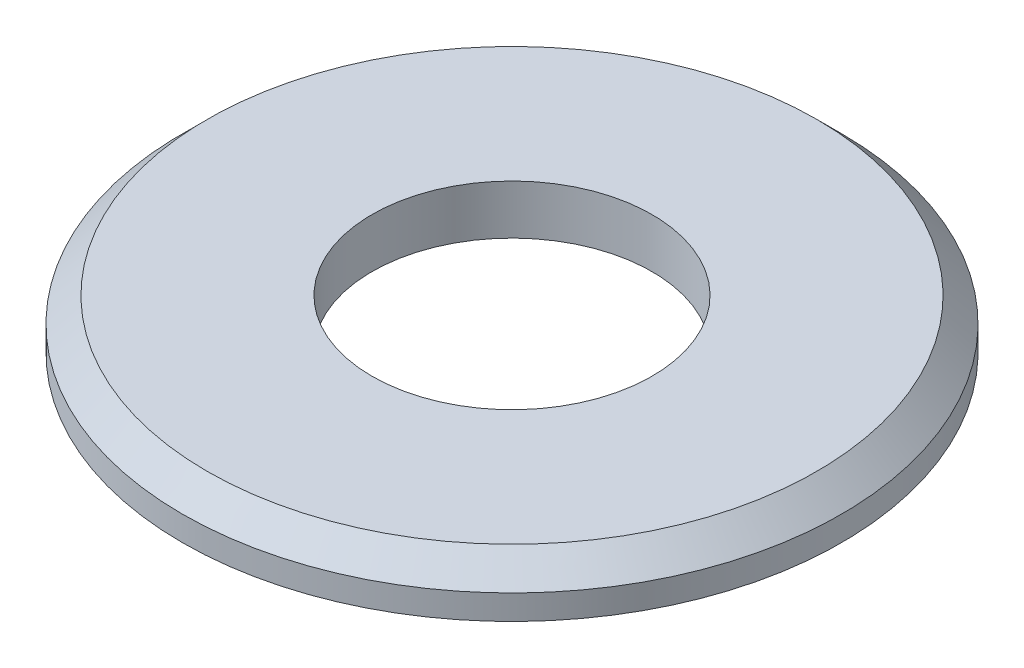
ISO-10303-21;
HEADER;
FILE_DESCRIPTION(('STEP AP214'),'2;1');
FILE_NAME('part.step','',(''),(''),'','','');
FILE_SCHEMA(('AUTOMOTIVE_DESIGN { 1 0 10303 214 1 1 1 1 }'));
ENDSEC;
DATA;
#1=APPLICATION_CONTEXT('core data for automotive mechanical design processes');
#2=APPLICATION_PROTOCOL_DEFINITION('international standard','automotive_design',2000,#1);
#3=PRODUCT_CONTEXT('',#1,'mechanical');
#4=PRODUCT('Part','Part','',(#3));
#5=PRODUCT_RELATED_PRODUCT_CATEGORY('part','',(#4));
#6=PRODUCT_DEFINITION_FORMATION('','',#4);
#7=PRODUCT_DEFINITION_CONTEXT('part definition',#1,'design');
#8=PRODUCT_DEFINITION('design','',#6,#7);
#9=PRODUCT_DEFINITION_SHAPE('','',#8);
#10=(LENGTH_UNIT() NAMED_UNIT(*) SI_UNIT(.MILLI.,.METRE.));
#11=(NAMED_UNIT(*) PLANE_ANGLE_UNIT() SI_UNIT($,.RADIAN.));
#12=(NAMED_UNIT(*) SI_UNIT($,.STERADIAN.) SOLID_ANGLE_UNIT());
#13=UNCERTAINTY_MEASURE_WITH_UNIT(LENGTH_MEASURE(1.E-05),#10,'distance_accuracy_value','');
#14=(GEOMETRIC_REPRESENTATION_CONTEXT(3) GLOBAL_UNCERTAINTY_ASSIGNED_CONTEXT((#13)) GLOBAL_UNIT_ASSIGNED_CONTEXT((#10,
#11,#12)) REPRESENTATION_CONTEXT('',''));
#15=CARTESIAN_POINT('',(0.,0.,0.));
#16=DIRECTION('',(0.,0.,1.));
#17=DIRECTION('',(1.,0.,0.));
#18=AXIS2_PLACEMENT_3D('',#15,#16,#17);
#19=CARTESIAN_POINT('',(0.,0.3,0.));
#20=DIRECTION('',(0.,1.,0.));
#21=DIRECTION('',(0.,0.,1.));
#22=AXIS2_PLACEMENT_3D('',#19,#20,#21);
#23=PLANE('',#22);
#24=CARTESIAN_POINT('',(0.,0.3,0.));
#25=DIRECTION('',(0.,1.,0.));
#26=DIRECTION('',(0.,0.,1.));
#27=AXIS2_PLACEMENT_3D('',#24,#25,#26);
#28=CIRCLE('',#27,1.85);
#29=CARTESIAN_POINT('',(0.,0.3,1.85));
#30=VERTEX_POINT('',#29);
#31=EDGE_CURVE('E35',#30,#30,#28,.T.);
#32=ORIENTED_EDGE('',*,*,#31,.T.);
#33=EDGE_LOOP('',(#32));
#34=FACE_BOUND('',#33,.T.);
#35=CARTESIAN_POINT('',(0.,0.3,0.));
#36=DIRECTION('',(0.,1.,0.));
#37=DIRECTION('',(0.,0.,1.));
#38=AXIS2_PLACEMENT_3D('',#35,#36,#37);
#39=CIRCLE('',#38,0.85);
#40=CARTESIAN_POINT('',(0.,0.3,0.85));
#41=VERTEX_POINT('',#40);
#42=EDGE_CURVE('E43',#41,#41,#39,.T.);
#43=ORIENTED_EDGE('',*,*,#42,.F.);
#44=EDGE_LOOP('',(#43));
#45=FACE_BOUND('',#44,.T.);
#46=ADVANCED_FACE('F28',(#34,#45),#23,.T.);
#47=CARTESIAN_POINT('',(0.,0.,0.));
#48=DIRECTION('',(0.,1.,0.));
#49=DIRECTION('',(0.,0.,1.));
#50=AXIS2_PLACEMENT_3D('',#47,#48,#49);
#51=PLANE('',#50);
#52=CARTESIAN_POINT('',(0.,0.,0.));
#53=DIRECTION('',(0.,1.,0.));
#54=DIRECTION('',(0.,0.,1.));
#55=AXIS2_PLACEMENT_3D('',#52,#53,#54);
#56=CIRCLE('',#55,2.);
#57=CARTESIAN_POINT('',(0.,0.,2.));
#58=VERTEX_POINT('',#57);
#59=EDGE_CURVE('E39',#58,#58,#56,.T.);
#60=ORIENTED_EDGE('',*,*,#59,.F.);
#61=EDGE_LOOP('',(#60));
#62=FACE_BOUND('',#61,.T.);
#63=CARTESIAN_POINT('',(0.,0.,0.));
#64=DIRECTION('',(0.,1.,0.));
#65=DIRECTION('',(0.,0.,1.));
#66=AXIS2_PLACEMENT_3D('',#63,#64,#65);
#67=CIRCLE('',#66,0.85);
#68=CARTESIAN_POINT('',(0.,0.,0.85));
#69=VERTEX_POINT('',#68);
#70=EDGE_CURVE('E48',#69,#69,#67,.T.);
#71=ORIENTED_EDGE('',*,*,#70,.T.);
#72=EDGE_LOOP('',(#71));
#73=FACE_BOUND('',#72,.T.);
#74=ADVANCED_FACE('F52',(#62,#73),#51,.F.);
#75=CARTESIAN_POINT('',(0.,0.3,0.));
#76=DIRECTION('',(0.,-1.,0.));
#77=DIRECTION('',(0.,0.,-1.));
#78=AXIS2_PLACEMENT_3D('',#75,#76,#77);
#79=CYLINDRICAL_SURFACE('',#78,2.);
#80=CARTESIAN_POINT('',(0.,0.15,0.));
#81=DIRECTION('',(0.,1.,0.));
#82=DIRECTION('',(0.,0.,1.));
#83=AXIS2_PLACEMENT_3D('',#80,#81,#82);
#84=CIRCLE('',#83,2.);
#85=CARTESIAN_POINT('',(0.,0.15,2.));
#86=VERTEX_POINT('',#85);
#87=EDGE_CURVE('E10',#86,#86,#84,.F.);
#88=ORIENTED_EDGE('',*,*,#87,.T.);
#89=EDGE_LOOP('',(#88));
#90=FACE_BOUND('',#89,.T.);
#91=ORIENTED_EDGE('',*,*,#59,.T.);
#92=EDGE_LOOP('',(#91));
#93=FACE_BOUND('',#92,.T.);
#94=ADVANCED_FACE('F30',(#90,#93),#79,.T.);
#95=CARTESIAN_POINT('',(0.,0.3,0.));
#96=DIRECTION('',(0.,-1.,0.));
#97=DIRECTION('',(0.,0.,-1.));
#98=AXIS2_PLACEMENT_3D('',#95,#96,#97);
#99=CYLINDRICAL_SURFACE('',#98,0.85);
#100=ORIENTED_EDGE('',*,*,#42,.T.);
#101=EDGE_LOOP('',(#100));
#102=FACE_BOUND('',#101,.T.);
#103=ORIENTED_EDGE('',*,*,#70,.F.);
#104=EDGE_LOOP('',(#103));
#105=FACE_BOUND('',#104,.T.);
#106=ADVANCED_FACE('F54',(#102,#105),#99,.F.);
#107=CARTESIAN_POINT('',(0.,0.3,0.));
#108=DIRECTION('',(0.,-1.,0.));
#109=DIRECTION('',(0.,0.,-1.));
#110=AXIS2_PLACEMENT_3D('',#107,#108,#109);
#111=CONICAL_SURFACE('',#110,1.85,0.78539816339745);
#112=ORIENTED_EDGE('',*,*,#87,.F.);
#113=EDGE_LOOP('',(#112));
#114=FACE_BOUND('',#113,.T.);
#115=ORIENTED_EDGE('',*,*,#31,.F.);
#116=EDGE_LOOP('',(#115));
#117=FACE_BOUND('',#116,.T.);
#118=ADVANCED_FACE('F56',(#114,#117),#111,.T.);
#119=CLOSED_SHELL('',(#46,#74,#94,#106,#118));
#120=MANIFOLD_SOLID_BREP('B2',#119);
#121=ADVANCED_BREP_SHAPE_REPRESENTATION('',(#18,#120),#14);
#122=SHAPE_DEFINITION_REPRESENTATION(#9,#121);
ENDSEC;
END-ISO-10303-21;
